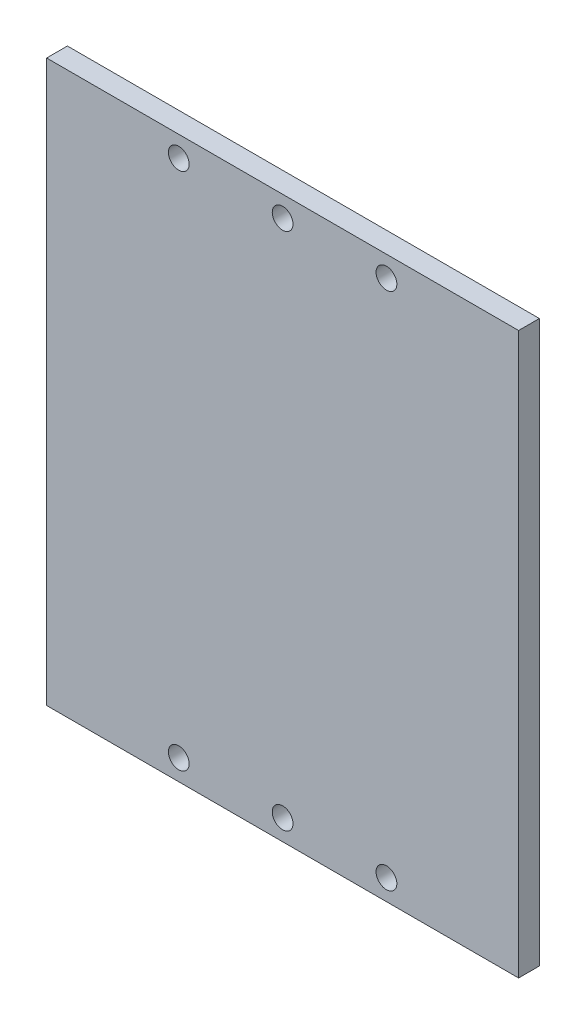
ISO-10303-21;
HEADER;
FILE_DESCRIPTION(('STEP AP214'),'2;1');
FILE_NAME('part.step','',(''),(''),'','','');
FILE_SCHEMA(('AUTOMOTIVE_DESIGN { 1 0 10303 214 1 1 1 1 }'));
ENDSEC;
DATA;
#1=APPLICATION_CONTEXT('core data for automotive mechanical design processes');
#2=APPLICATION_PROTOCOL_DEFINITION('international standard','automotive_design',2000,#1);
#3=PRODUCT_CONTEXT('',#1,'mechanical');
#4=PRODUCT('Part','Part','',(#3));
#5=PRODUCT_RELATED_PRODUCT_CATEGORY('part','',(#4));
#6=PRODUCT_DEFINITION_FORMATION('','',#4);
#7=PRODUCT_DEFINITION_CONTEXT('part definition',#1,'design');
#8=PRODUCT_DEFINITION('design','',#6,#7);
#9=PRODUCT_DEFINITION_SHAPE('','',#8);
#10=(LENGTH_UNIT() NAMED_UNIT(*) SI_UNIT(.MILLI.,.METRE.));
#11=(NAMED_UNIT(*) PLANE_ANGLE_UNIT() SI_UNIT($,.RADIAN.));
#12=(NAMED_UNIT(*) SI_UNIT($,.STERADIAN.) SOLID_ANGLE_UNIT());
#13=UNCERTAINTY_MEASURE_WITH_UNIT(LENGTH_MEASURE(1.E-05),#10,'distance_accuracy_value','');
#14=(GEOMETRIC_REPRESENTATION_CONTEXT(3) GLOBAL_UNCERTAINTY_ASSIGNED_CONTEXT((#13)) GLOBAL_UNIT_ASSIGNED_CONTEXT((#10,
#11,#12)) REPRESENTATION_CONTEXT('',''));
#15=CARTESIAN_POINT('',(0.,0.,0.));
#16=DIRECTION('',(0.,0.,1.));
#17=DIRECTION('',(1.,0.,0.));
#18=AXIS2_PLACEMENT_3D('',#15,#16,#17);
#19=CARTESIAN_POINT('',(0.,0.,2.));
#20=DIRECTION('',(0.,0.,1.));
#21=DIRECTION('',(1.,0.,0.));
#22=AXIS2_PLACEMENT_3D('',#19,#20,#21);
#23=PLANE('',#22);
#24=CARTESIAN_POINT('',(-8.75499999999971,3.00000000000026,2.));
#25=DIRECTION('',(0.,0.,1.));
#26=DIRECTION('',(-1.,0.,0.));
#27=AXIS2_PLACEMENT_3D('',#24,#25,#26);
#28=CIRCLE('',#27,1.);
#29=CARTESIAN_POINT('',(-9.75499999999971,3.00000000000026,2.));
#30=VERTEX_POINT('',#29);
#31=EDGE_CURVE('E164',#30,#30,#28,.T.);
#32=ORIENTED_EDGE('',*,*,#31,.F.);
#33=EDGE_LOOP('',(#32));
#34=FACE_BOUND('',#33,.T.);
#35=CARTESIAN_POINT('',(-18.7549999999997,-46.9999999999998,2.));
#36=DIRECTION('',(0.,0.,1.));
#37=DIRECTION('',(1.,0.,0.));
#38=AXIS2_PLACEMENT_3D('',#35,#36,#37);
#39=CIRCLE('',#38,1.);
#40=CARTESIAN_POINT('',(-17.7549999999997,-46.9999999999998,2.));
#41=VERTEX_POINT('',#40);
#42=EDGE_CURVE('E148',#41,#41,#39,.T.);
#43=ORIENTED_EDGE('',*,*,#42,.F.);
#44=EDGE_LOOP('',(#43));
#45=FACE_BOUND('',#44,.T.);
#46=CARTESIAN_POINT('',(-8.7549999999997,-46.9999999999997,2.));
#47=DIRECTION('',(0.,0.,1.));
#48=DIRECTION('',(1.,0.,0.));
#49=AXIS2_PLACEMENT_3D('',#46,#47,#48);
#50=CIRCLE('',#49,1.);
#51=CARTESIAN_POINT('',(-7.7549999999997,-46.9999999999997,2.));
#52=VERTEX_POINT('',#51);
#53=EDGE_CURVE('E118',#52,#52,#50,.T.);
#54=ORIENTED_EDGE('',*,*,#53,.F.);
#55=EDGE_LOOP('',(#54));
#56=FACE_BOUND('',#55,.T.);
#57=DIRECTION('',(0.,-1.,0.));
#58=VECTOR('',#57,1.);
#59=CARTESIAN_POINT('',(-31.4799999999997,5.00000000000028,2.));
#60=LINE('',#59,#58);
#61=CARTESIAN_POINT('',(-31.4799999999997,5.00000000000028,2.));
#62=VERTEX_POINT('',#61);
#63=CARTESIAN_POINT('',(-31.4799999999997,-48.9999999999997,2.));
#64=VERTEX_POINT('',#63);
#65=EDGE_CURVE('E98',#62,#64,#60,.T.);
#66=ORIENTED_EDGE('',*,*,#65,.T.);
#67=DIRECTION('',(1.,0.,0.));
#68=VECTOR('',#67,1.);
#69=CARTESIAN_POINT('',(-31.4799999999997,-48.9999999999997,2.));
#70=LINE('',#69,#68);
#71=CARTESIAN_POINT('',(13.9700000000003,-48.9999999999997,2.));
#72=VERTEX_POINT('',#71);
#73=EDGE_CURVE('E93',#64,#72,#70,.T.);
#74=ORIENTED_EDGE('',*,*,#73,.T.);
#75=DIRECTION('',(0.,1.,0.));
#76=VECTOR('',#75,1.);
#77=CARTESIAN_POINT('',(13.9700000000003,5.00000000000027,2.));
#78=LINE('',#77,#76);
#79=CARTESIAN_POINT('',(13.9700000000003,5.00000000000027,2.));
#80=VERTEX_POINT('',#79);
#81=EDGE_CURVE('E96',#72,#80,#78,.T.);
#82=ORIENTED_EDGE('',*,*,#81,.T.);
#83=DIRECTION('',(-1.,0.,0.));
#84=VECTOR('',#83,1.);
#85=CARTESIAN_POINT('',(-31.4799999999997,5.00000000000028,2.));
#86=LINE('',#85,#84);
#87=EDGE_CURVE('E63',#80,#62,#86,.T.);
#88=ORIENTED_EDGE('',*,*,#87,.T.);
#89=EDGE_LOOP('',(#66,#74,#82,#88));
#90=FACE_BOUND('',#89,.T.);
#91=CARTESIAN_POINT('',(1.2450000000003,-46.9999999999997,2.));
#92=DIRECTION('',(0.,0.,1.));
#93=DIRECTION('',(1.,0.,0.));
#94=AXIS2_PLACEMENT_3D('',#91,#92,#93);
#95=CIRCLE('',#94,1.);
#96=CARTESIAN_POINT('',(2.2450000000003,-46.9999999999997,2.));
#97=VERTEX_POINT('',#96);
#98=EDGE_CURVE('E140',#97,#97,#95,.T.);
#99=ORIENTED_EDGE('',*,*,#98,.F.);
#100=EDGE_LOOP('',(#99));
#101=FACE_BOUND('',#100,.T.);
#102=CARTESIAN_POINT('',(1.2450000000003,3.00000000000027,2.));
#103=DIRECTION('',(0.,0.,1.));
#104=DIRECTION('',(-1.,0.,0.));
#105=AXIS2_PLACEMENT_3D('',#102,#103,#104);
#106=CIRCLE('',#105,1.);
#107=CARTESIAN_POINT('',(0.245000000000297,3.00000000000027,2.));
#108=VERTEX_POINT('',#107);
#109=EDGE_CURVE('E156',#108,#108,#106,.T.);
#110=ORIENTED_EDGE('',*,*,#109,.F.);
#111=EDGE_LOOP('',(#110));
#112=FACE_BOUND('',#111,.T.);
#113=CARTESIAN_POINT('',(-18.7549999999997,3.00000000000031,2.));
#114=DIRECTION('',(0.,0.,1.));
#115=DIRECTION('',(-1.,0.,0.));
#116=AXIS2_PLACEMENT_3D('',#113,#114,#115);
#117=CIRCLE('',#116,1.);
#118=CARTESIAN_POINT('',(-19.7549999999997,3.00000000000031,2.));
#119=VERTEX_POINT('',#118);
#120=EDGE_CURVE('E172',#119,#119,#117,.T.);
#121=ORIENTED_EDGE('',*,*,#120,.F.);
#122=EDGE_LOOP('',(#121));
#123=FACE_BOUND('',#122,.T.);
#124=ADVANCED_FACE('F45',(#34,#45,#56,#90,#101,#112,#123),#23,.T.);
#125=CARTESIAN_POINT('',(0.,0.,0.));
#126=DIRECTION('',(0.,0.,1.));
#127=DIRECTION('',(1.,0.,0.));
#128=AXIS2_PLACEMENT_3D('',#125,#126,#127);
#129=PLANE('',#128);
#130=DIRECTION('',(0.,-1.,0.));
#131=VECTOR('',#130,1.);
#132=CARTESIAN_POINT('',(-31.4799999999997,5.00000000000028,0.));
#133=LINE('',#132,#131);
#134=CARTESIAN_POINT('',(-31.4799999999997,5.00000000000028,0.));
#135=VERTEX_POINT('',#134);
#136=CARTESIAN_POINT('',(-31.4799999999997,-48.9999999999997,0.));
#137=VERTEX_POINT('',#136);
#138=EDGE_CURVE('E114',#135,#137,#133,.T.);
#139=ORIENTED_EDGE('',*,*,#138,.F.);
#140=DIRECTION('',(-1.,0.,0.));
#141=VECTOR('',#140,1.);
#142=CARTESIAN_POINT('',(-31.4799999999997,5.00000000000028,0.));
#143=LINE('',#142,#141);
#144=CARTESIAN_POINT('',(13.9700000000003,5.00000000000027,0.));
#145=VERTEX_POINT('',#144);
#146=EDGE_CURVE('E86',#145,#135,#143,.T.);
#147=ORIENTED_EDGE('',*,*,#146,.F.);
#148=DIRECTION('',(0.,1.,0.));
#149=VECTOR('',#148,1.);
#150=CARTESIAN_POINT('',(13.9700000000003,5.00000000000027,0.));
#151=LINE('',#150,#149);
#152=CARTESIAN_POINT('',(13.9700000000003,-48.9999999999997,0.));
#153=VERTEX_POINT('',#152);
#154=EDGE_CURVE('E80',#153,#145,#151,.T.);
#155=ORIENTED_EDGE('',*,*,#154,.F.);
#156=DIRECTION('',(1.,0.,0.));
#157=VECTOR('',#156,1.);
#158=CARTESIAN_POINT('',(-31.4799999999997,-48.9999999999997,0.));
#159=LINE('',#158,#157);
#160=EDGE_CURVE('E103',#137,#153,#159,.T.);
#161=ORIENTED_EDGE('',*,*,#160,.F.);
#162=EDGE_LOOP('',(#139,#147,#155,#161));
#163=FACE_BOUND('',#162,.T.);
#164=CARTESIAN_POINT('',(-8.7549999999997,-46.9999999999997,0.));
#165=DIRECTION('',(0.,0.,1.));
#166=DIRECTION('',(1.,0.,0.));
#167=AXIS2_PLACEMENT_3D('',#164,#165,#166);
#168=CIRCLE('',#167,1.);
#169=CARTESIAN_POINT('',(-7.7549999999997,-46.9999999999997,0.));
#170=VERTEX_POINT('',#169);
#171=EDGE_CURVE('E136',#170,#170,#168,.T.);
#172=ORIENTED_EDGE('',*,*,#171,.T.);
#173=EDGE_LOOP('',(#172));
#174=FACE_BOUND('',#173,.T.);
#175=CARTESIAN_POINT('',(1.2450000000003,-46.9999999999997,0.));
#176=DIRECTION('',(0.,0.,1.));
#177=DIRECTION('',(1.,0.,0.));
#178=AXIS2_PLACEMENT_3D('',#175,#176,#177);
#179=CIRCLE('',#178,1.);
#180=CARTESIAN_POINT('',(2.2450000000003,-46.9999999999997,0.));
#181=VERTEX_POINT('',#180);
#182=EDGE_CURVE('E144',#181,#181,#179,.T.);
#183=ORIENTED_EDGE('',*,*,#182,.T.);
#184=EDGE_LOOP('',(#183));
#185=FACE_BOUND('',#184,.T.);
#186=CARTESIAN_POINT('',(-18.7549999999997,-46.9999999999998,0.));
#187=DIRECTION('',(0.,0.,1.));
#188=DIRECTION('',(1.,0.,0.));
#189=AXIS2_PLACEMENT_3D('',#186,#187,#188);
#190=CIRCLE('',#189,1.);
#191=CARTESIAN_POINT('',(-17.7549999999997,-46.9999999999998,0.));
#192=VERTEX_POINT('',#191);
#193=EDGE_CURVE('E152',#192,#192,#190,.T.);
#194=ORIENTED_EDGE('',*,*,#193,.T.);
#195=EDGE_LOOP('',(#194));
#196=FACE_BOUND('',#195,.T.);
#197=CARTESIAN_POINT('',(1.2450000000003,3.00000000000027,0.));
#198=DIRECTION('',(0.,0.,1.));
#199=DIRECTION('',(-1.,0.,0.));
#200=AXIS2_PLACEMENT_3D('',#197,#198,#199);
#201=CIRCLE('',#200,1.);
#202=CARTESIAN_POINT('',(0.245000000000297,3.00000000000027,0.));
#203=VERTEX_POINT('',#202);
#204=EDGE_CURVE('E160',#203,#203,#201,.T.);
#205=ORIENTED_EDGE('',*,*,#204,.T.);
#206=EDGE_LOOP('',(#205));
#207=FACE_BOUND('',#206,.T.);
#208=CARTESIAN_POINT('',(-8.75499999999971,3.00000000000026,0.));
#209=DIRECTION('',(0.,0.,1.));
#210=DIRECTION('',(-1.,0.,0.));
#211=AXIS2_PLACEMENT_3D('',#208,#209,#210);
#212=CIRCLE('',#211,1.);
#213=CARTESIAN_POINT('',(-9.75499999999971,3.00000000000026,0.));
#214=VERTEX_POINT('',#213);
#215=EDGE_CURVE('E168',#214,#214,#212,.T.);
#216=ORIENTED_EDGE('',*,*,#215,.T.);
#217=EDGE_LOOP('',(#216));
#218=FACE_BOUND('',#217,.T.);
#219=CARTESIAN_POINT('',(-18.7549999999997,3.00000000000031,0.));
#220=DIRECTION('',(0.,0.,1.));
#221=DIRECTION('',(-1.,0.,0.));
#222=AXIS2_PLACEMENT_3D('',#219,#220,#221);
#223=CIRCLE('',#222,1.);
#224=CARTESIAN_POINT('',(-19.7549999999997,3.00000000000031,0.));
#225=VERTEX_POINT('',#224);
#226=EDGE_CURVE('E176',#225,#225,#223,.T.);
#227=ORIENTED_EDGE('',*,*,#226,.T.);
#228=EDGE_LOOP('',(#227));
#229=FACE_BOUND('',#228,.T.);
#230=ADVANCED_FACE('F131',(#163,#174,#185,#196,#207,#218,#229),#129,.F.);
#231=CARTESIAN_POINT('',(-31.4799999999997,5.00000000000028,2.));
#232=DIRECTION('',(1.,0.,0.));
#233=DIRECTION('',(0.,1.,0.));
#234=AXIS2_PLACEMENT_3D('',#231,#232,#233);
#235=PLANE('',#234);
#236=ORIENTED_EDGE('',*,*,#138,.T.);
#237=DIRECTION('',(0.,0.,-1.));
#238=VECTOR('',#237,1.);
#239=CARTESIAN_POINT('',(-31.4799999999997,-48.9999999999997,2.));
#240=LINE('',#239,#238);
#241=EDGE_CURVE('E11',#64,#137,#240,.T.);
#242=ORIENTED_EDGE('',*,*,#241,.F.);
#243=ORIENTED_EDGE('',*,*,#65,.F.);
#244=DIRECTION('',(0.,0.,-1.));
#245=VECTOR('',#244,1.);
#246=CARTESIAN_POINT('',(-31.4799999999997,5.00000000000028,2.));
#247=LINE('',#246,#245);
#248=EDGE_CURVE('E110',#62,#135,#247,.T.);
#249=ORIENTED_EDGE('',*,*,#248,.T.);
#250=EDGE_LOOP('',(#236,#242,#243,#249));
#251=FACE_BOUND('',#250,.T.);
#252=ADVANCED_FACE('F47',(#251),#235,.F.);
#253=CARTESIAN_POINT('',(-31.4799999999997,-48.9999999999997,2.));
#254=DIRECTION('',(0.,1.,0.));
#255=DIRECTION('',(0.,0.,1.));
#256=AXIS2_PLACEMENT_3D('',#253,#254,#255);
#257=PLANE('',#256);
#258=ORIENTED_EDGE('',*,*,#160,.T.);
#259=DIRECTION('',(0.,0.,-1.));
#260=VECTOR('',#259,1.);
#261=CARTESIAN_POINT('',(13.9700000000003,-48.9999999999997,2.));
#262=LINE('',#261,#260);
#263=EDGE_CURVE('E55',#72,#153,#262,.T.);
#264=ORIENTED_EDGE('',*,*,#263,.F.);
#265=ORIENTED_EDGE('',*,*,#73,.F.);
#266=ORIENTED_EDGE('',*,*,#241,.T.);
#267=EDGE_LOOP('',(#258,#264,#265,#266));
#268=FACE_BOUND('',#267,.T.);
#269=ADVANCED_FACE('F102',(#268),#257,.F.);
#270=CARTESIAN_POINT('',(13.9700000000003,5.00000000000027,2.));
#271=DIRECTION('',(-1.,0.,0.));
#272=DIRECTION('',(0.,-1.,0.));
#273=AXIS2_PLACEMENT_3D('',#270,#271,#272);
#274=PLANE('',#273);
#275=ORIENTED_EDGE('',*,*,#154,.T.);
#276=DIRECTION('',(0.,0.,-1.));
#277=VECTOR('',#276,1.);
#278=CARTESIAN_POINT('',(13.9700000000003,5.00000000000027,2.));
#279=LINE('',#278,#277);
#280=EDGE_CURVE('E105',#80,#145,#279,.T.);
#281=ORIENTED_EDGE('',*,*,#280,.F.);
#282=ORIENTED_EDGE('',*,*,#81,.F.);
#283=ORIENTED_EDGE('',*,*,#263,.T.);
#284=EDGE_LOOP('',(#275,#281,#282,#283));
#285=FACE_BOUND('',#284,.T.);
#286=ADVANCED_FACE('F106',(#285),#274,.F.);
#287=CARTESIAN_POINT('',(-31.4799999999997,5.00000000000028,2.));
#288=DIRECTION('',(0.,-1.,0.));
#289=DIRECTION('',(1.,0.,0.));
#290=AXIS2_PLACEMENT_3D('',#287,#288,#289);
#291=PLANE('',#290);
#292=ORIENTED_EDGE('',*,*,#146,.T.);
#293=ORIENTED_EDGE('',*,*,#248,.F.);
#294=ORIENTED_EDGE('',*,*,#87,.F.);
#295=ORIENTED_EDGE('',*,*,#280,.T.);
#296=EDGE_LOOP('',(#292,#293,#294,#295));
#297=FACE_BOUND('',#296,.T.);
#298=ADVANCED_FACE('F128',(#297),#291,.F.);
#299=CARTESIAN_POINT('',(-8.7549999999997,-46.9999999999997,2.));
#300=DIRECTION('',(0.,0.,-1.));
#301=DIRECTION('',(-1.,0.,0.));
#302=AXIS2_PLACEMENT_3D('',#299,#300,#301);
#303=CYLINDRICAL_SURFACE('',#302,1.);
#304=ORIENTED_EDGE('',*,*,#53,.T.);
#305=EDGE_LOOP('',(#304));
#306=FACE_BOUND('',#305,.T.);
#307=ORIENTED_EDGE('',*,*,#171,.F.);
#308=EDGE_LOOP('',(#307));
#309=FACE_BOUND('',#308,.T.);
#310=ADVANCED_FACE('F197',(#306,#309),#303,.F.);
#311=CARTESIAN_POINT('',(1.2450000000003,-46.9999999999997,2.));
#312=DIRECTION('',(0.,0.,-1.));
#313=DIRECTION('',(-1.,0.,0.));
#314=AXIS2_PLACEMENT_3D('',#311,#312,#313);
#315=CYLINDRICAL_SURFACE('',#314,1.);
#316=ORIENTED_EDGE('',*,*,#98,.T.);
#317=EDGE_LOOP('',(#316));
#318=FACE_BOUND('',#317,.T.);
#319=ORIENTED_EDGE('',*,*,#182,.F.);
#320=EDGE_LOOP('',(#319));
#321=FACE_BOUND('',#320,.T.);
#322=ADVANCED_FACE('F242',(#318,#321),#315,.F.);
#323=CARTESIAN_POINT('',(-18.7549999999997,-46.9999999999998,2.));
#324=DIRECTION('',(0.,0.,-1.));
#325=DIRECTION('',(-1.,0.,0.));
#326=AXIS2_PLACEMENT_3D('',#323,#324,#325);
#327=CYLINDRICAL_SURFACE('',#326,1.);
#328=ORIENTED_EDGE('',*,*,#42,.T.);
#329=EDGE_LOOP('',(#328));
#330=FACE_BOUND('',#329,.T.);
#331=ORIENTED_EDGE('',*,*,#193,.F.);
#332=EDGE_LOOP('',(#331));
#333=FACE_BOUND('',#332,.T.);
#334=ADVANCED_FACE('F250',(#330,#333),#327,.F.);
#335=CARTESIAN_POINT('',(1.2450000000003,3.00000000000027,2.));
#336=DIRECTION('',(0.,0.,-1.));
#337=DIRECTION('',(-1.,0.,0.));
#338=AXIS2_PLACEMENT_3D('',#335,#336,#337);
#339=CYLINDRICAL_SURFACE('',#338,1.);
#340=ORIENTED_EDGE('',*,*,#109,.T.);
#341=EDGE_LOOP('',(#340));
#342=FACE_BOUND('',#341,.T.);
#343=ORIENTED_EDGE('',*,*,#204,.F.);
#344=EDGE_LOOP('',(#343));
#345=FACE_BOUND('',#344,.T.);
#346=ADVANCED_FACE('F258',(#342,#345),#339,.F.);
#347=CARTESIAN_POINT('',(-8.75499999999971,3.00000000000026,2.));
#348=DIRECTION('',(0.,0.,-1.));
#349=DIRECTION('',(-1.,0.,0.));
#350=AXIS2_PLACEMENT_3D('',#347,#348,#349);
#351=CYLINDRICAL_SURFACE('',#350,1.);
#352=ORIENTED_EDGE('',*,*,#31,.T.);
#353=EDGE_LOOP('',(#352));
#354=FACE_BOUND('',#353,.T.);
#355=ORIENTED_EDGE('',*,*,#215,.F.);
#356=EDGE_LOOP('',(#355));
#357=FACE_BOUND('',#356,.T.);
#358=ADVANCED_FACE('F267',(#354,#357),#351,.F.);
#359=CARTESIAN_POINT('',(-18.7549999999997,3.00000000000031,2.));
#360=DIRECTION('',(0.,0.,-1.));
#361=DIRECTION('',(-1.,0.,0.));
#362=AXIS2_PLACEMENT_3D('',#359,#360,#361);
#363=CYLINDRICAL_SURFACE('',#362,1.);
#364=ORIENTED_EDGE('',*,*,#120,.T.);
#365=EDGE_LOOP('',(#364));
#366=FACE_BOUND('',#365,.T.);
#367=ORIENTED_EDGE('',*,*,#226,.F.);
#368=EDGE_LOOP('',(#367));
#369=FACE_BOUND('',#368,.T.);
#370=ADVANCED_FACE('F184',(#366,#369),#363,.F.);
#371=CLOSED_SHELL('',(#124,#230,#252,#269,#286,#298,#310,#322,#334,#346,#358,#370));
#372=MANIFOLD_SOLID_BREP('B2',#371);
#373=ADVANCED_BREP_SHAPE_REPRESENTATION('',(#18,#372),#14);
#374=SHAPE_DEFINITION_REPRESENTATION(#9,#373);
ENDSEC;
END-ISO-10303-21;
